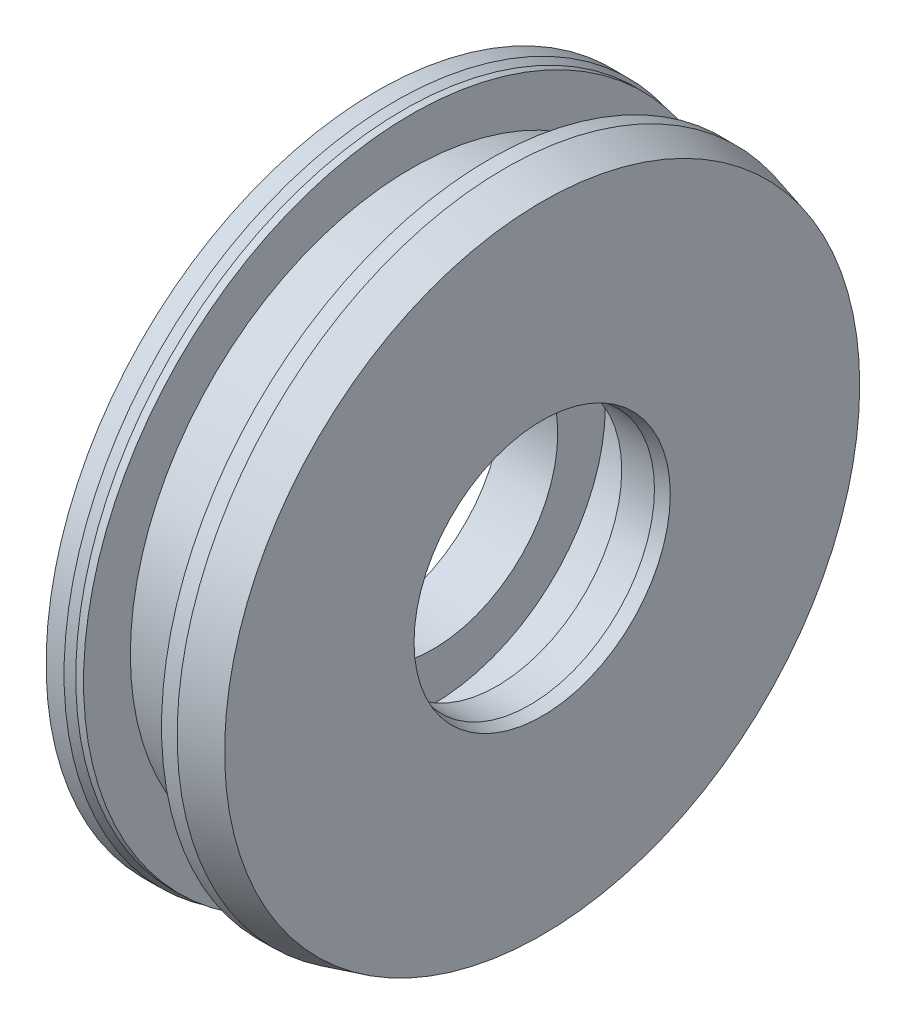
ISO-10303-21;
HEADER;
FILE_DESCRIPTION(('STEP AP214'),'2;1');
FILE_NAME('part.step','',(''),(''),'','','');
FILE_SCHEMA(('AUTOMOTIVE_DESIGN { 1 0 10303 214 1 1 1 1 }'));
ENDSEC;
DATA;
#1=APPLICATION_CONTEXT('core data for automotive mechanical design processes');
#2=APPLICATION_PROTOCOL_DEFINITION('international standard','automotive_design',2000,#1);
#3=PRODUCT_CONTEXT('',#1,'mechanical');
#4=PRODUCT('Part','Part','',(#3));
#5=PRODUCT_RELATED_PRODUCT_CATEGORY('part','',(#4));
#6=PRODUCT_DEFINITION_FORMATION('','',#4);
#7=PRODUCT_DEFINITION_CONTEXT('part definition',#1,'design');
#8=PRODUCT_DEFINITION('design','',#6,#7);
#9=PRODUCT_DEFINITION_SHAPE('','',#8);
#10=(LENGTH_UNIT() NAMED_UNIT(*) SI_UNIT(.MILLI.,.METRE.));
#11=(NAMED_UNIT(*) PLANE_ANGLE_UNIT() SI_UNIT($,.RADIAN.));
#12=(NAMED_UNIT(*) SI_UNIT($,.STERADIAN.) SOLID_ANGLE_UNIT());
#13=UNCERTAINTY_MEASURE_WITH_UNIT(LENGTH_MEASURE(1.E-05),#10,'distance_accuracy_value','');
#14=(GEOMETRIC_REPRESENTATION_CONTEXT(3) GLOBAL_UNCERTAINTY_ASSIGNED_CONTEXT((#13)) GLOBAL_UNIT_ASSIGNED_CONTEXT((#10,
#11,#12)) REPRESENTATION_CONTEXT('',''));
#15=CARTESIAN_POINT('',(0.,0.,0.));
#16=DIRECTION('',(0.,0.,1.));
#17=DIRECTION('',(1.,0.,0.));
#18=AXIS2_PLACEMENT_3D('',#15,#16,#17);
#19=CARTESIAN_POINT('',(0.,4.00000000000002,0.));
#20=DIRECTION('',(-1.,0.,0.));
#21=DIRECTION('',(0.,0.,1.));
#22=AXIS2_PLACEMENT_3D('',#19,#20,#21);
#23=PLANE('',#22);
#24=CARTESIAN_POINT('',(0.,0.,0.));
#25=DIRECTION('',(1.,0.,0.));
#26=DIRECTION('',(0.,0.,-1.));
#27=AXIS2_PLACEMENT_3D('',#24,#25,#26);
#28=CIRCLE('',#27,4.);
#29=CARTESIAN_POINT('',(0.,0.,-4.00000000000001));
#30=VERTEX_POINT('',#29);
#31=EDGE_CURVE('E400',#30,#30,#28,.T.);
#32=ORIENTED_EDGE('',*,*,#31,.T.);
#33=EDGE_LOOP('',(#32));
#34=FACE_BOUND('',#33,.T.);
#35=CARTESIAN_POINT('',(0.,0.,0.));
#36=DIRECTION('',(1.,0.,0.));
#37=DIRECTION('',(0.,0.,-1.));
#38=AXIS2_PLACEMENT_3D('',#35,#36,#37);
#39=CIRCLE('',#38,10.6);
#40=CARTESIAN_POINT('',(0.,0.,-10.6));
#41=VERTEX_POINT('',#40);
#42=EDGE_CURVE('E10',#41,#41,#39,.T.);
#43=ORIENTED_EDGE('',*,*,#42,.F.);
#44=EDGE_LOOP('',(#43));
#45=FACE_BOUND('',#44,.T.);
#46=ADVANCED_FACE('F348',(#34,#45),#23,.T.);
#47=CARTESIAN_POINT('',(0.,0.,0.));
#48=DIRECTION('',(1.,0.,0.));
#49=DIRECTION('',(0.,0.,-1.));
#50=AXIS2_PLACEMENT_3D('',#47,#48,#49);
#51=CYLINDRICAL_SURFACE('',#50,10.6);
#52=ORIENTED_EDGE('',*,*,#42,.T.);
#53=EDGE_LOOP('',(#52));
#54=FACE_BOUND('',#53,.T.);
#55=CARTESIAN_POINT('',(0.575252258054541,0.,0.));
#56=DIRECTION('',(1.,0.,0.));
#57=DIRECTION('',(0.,0.,-1.));
#58=AXIS2_PLACEMENT_3D('',#55,#56,#57);
#59=CIRCLE('',#58,10.6);
#60=CARTESIAN_POINT('',(0.575252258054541,0.,-10.6));
#61=VERTEX_POINT('',#60);
#62=EDGE_CURVE('E354',#61,#61,#59,.T.);
#63=ORIENTED_EDGE('',*,*,#62,.F.);
#64=EDGE_LOOP('',(#63));
#65=FACE_BOUND('',#64,.T.);
#66=ADVANCED_FACE('F418',(#54,#65),#51,.T.);
#67=CARTESIAN_POINT('',(0.85,0.,0.));
#68=DIRECTION('',(-1.,0.,0.));
#69=DIRECTION('',(0.,0.,1.));
#70=AXIS2_PLACEMENT_3D('',#67,#68,#69);
#71=CONICAL_SURFACE('',#70,10.5,0.349065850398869);
#72=ORIENTED_EDGE('',*,*,#62,.T.);
#73=EDGE_LOOP('',(#72));
#74=FACE_BOUND('',#73,.T.);
#75=CARTESIAN_POINT('',(0.85,0.,0.));
#76=DIRECTION('',(1.,0.,0.));
#77=DIRECTION('',(0.,0.,-1.));
#78=AXIS2_PLACEMENT_3D('',#75,#76,#77);
#79=CIRCLE('',#78,10.5);
#80=CARTESIAN_POINT('',(0.85,0.,-10.5));
#81=VERTEX_POINT('',#80);
#82=EDGE_CURVE('E358',#81,#81,#79,.T.);
#83=ORIENTED_EDGE('',*,*,#82,.F.);
#84=EDGE_LOOP('',(#83));
#85=FACE_BOUND('',#84,.T.);
#86=ADVANCED_FACE('F422',(#74,#85),#71,.T.);
#87=CARTESIAN_POINT('',(0.,0.,0.));
#88=DIRECTION('',(1.,0.,0.));
#89=DIRECTION('',(0.,0.,-1.));
#90=AXIS2_PLACEMENT_3D('',#87,#88,#89);
#91=CYLINDRICAL_SURFACE('',#90,10.5);
#92=ORIENTED_EDGE('',*,*,#82,.T.);
#93=EDGE_LOOP('',(#92));
#94=FACE_BOUND('',#93,.T.);
#95=CARTESIAN_POINT('',(1.1,0.,0.));
#96=DIRECTION('',(1.,0.,0.));
#97=DIRECTION('',(0.,0.,-1.));
#98=AXIS2_PLACEMENT_3D('',#95,#96,#97);
#99=CIRCLE('',#98,10.5);
#100=CARTESIAN_POINT('',(1.1,0.,-10.5));
#101=VERTEX_POINT('',#100);
#102=EDGE_CURVE('E362',#101,#101,#99,.T.);
#103=ORIENTED_EDGE('',*,*,#102,.F.);
#104=EDGE_LOOP('',(#103));
#105=FACE_BOUND('',#104,.T.);
#106=ADVANCED_FACE('F426',(#94,#105),#91,.T.);
#107=CARTESIAN_POINT('',(1.1,10.5,0.));
#108=DIRECTION('',(1.,0.,0.));
#109=DIRECTION('',(0.,0.,-1.));
#110=AXIS2_PLACEMENT_3D('',#107,#108,#109);
#111=PLANE('',#110);
#112=ORIENTED_EDGE('',*,*,#102,.T.);
#113=EDGE_LOOP('',(#112));
#114=FACE_BOUND('',#113,.T.);
#115=CARTESIAN_POINT('',(1.1,0.,0.));
#116=DIRECTION('',(1.,0.,0.));
#117=DIRECTION('',(0.,0.,-1.));
#118=AXIS2_PLACEMENT_3D('',#115,#116,#117);
#119=CIRCLE('',#118,9.);
#120=CARTESIAN_POINT('',(1.1,0.,-9.00000000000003));
#121=VERTEX_POINT('',#120);
#122=EDGE_CURVE('E367',#121,#121,#119,.T.);
#123=ORIENTED_EDGE('',*,*,#122,.F.);
#124=EDGE_LOOP('',(#123));
#125=FACE_BOUND('',#124,.T.);
#126=ADVANCED_FACE('F432',(#114,#125),#111,.T.);
#127=CARTESIAN_POINT('',(0.,0.,0.));
#128=DIRECTION('',(1.,0.,0.));
#129=DIRECTION('',(0.,0.,-1.));
#130=AXIS2_PLACEMENT_3D('',#127,#128,#129);
#131=CYLINDRICAL_SURFACE('',#130,9.);
#132=ORIENTED_EDGE('',*,*,#122,.T.);
#133=EDGE_LOOP('',(#132));
#134=FACE_BOUND('',#133,.T.);
#135=CARTESIAN_POINT('',(3.6,0.,0.));
#136=DIRECTION('',(1.,0.,0.));
#137=DIRECTION('',(0.,0.,-1.));
#138=AXIS2_PLACEMENT_3D('',#135,#136,#137);
#139=CIRCLE('',#138,9.);
#140=CARTESIAN_POINT('',(3.6,0.,-9.00000000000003));
#141=VERTEX_POINT('',#140);
#142=EDGE_CURVE('E370',#141,#141,#139,.T.);
#143=ORIENTED_EDGE('',*,*,#142,.F.);
#144=EDGE_LOOP('',(#143));
#145=FACE_BOUND('',#144,.T.);
#146=ADVANCED_FACE('F436',(#134,#145),#131,.T.);
#147=CARTESIAN_POINT('',(3.6,9.00000000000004,0.));
#148=DIRECTION('',(-1.,0.,0.));
#149=DIRECTION('',(0.,0.,1.));
#150=AXIS2_PLACEMENT_3D('',#147,#148,#149);
#151=PLANE('',#150);
#152=ORIENTED_EDGE('',*,*,#142,.T.);
#153=EDGE_LOOP('',(#152));
#154=FACE_BOUND('',#153,.T.);
#155=CARTESIAN_POINT('',(3.6,0.,0.));
#156=DIRECTION('',(1.,0.,0.));
#157=DIRECTION('',(0.,0.,-1.));
#158=AXIS2_PLACEMENT_3D('',#155,#156,#157);
#159=CIRCLE('',#158,10.5);
#160=CARTESIAN_POINT('',(3.6,0.,-10.5));
#161=VERTEX_POINT('',#160);
#162=EDGE_CURVE('E373',#161,#161,#159,.T.);
#163=ORIENTED_EDGE('',*,*,#162,.F.);
#164=EDGE_LOOP('',(#163));
#165=FACE_BOUND('',#164,.T.);
#166=ADVANCED_FACE('F440',(#154,#165),#151,.T.);
#167=CARTESIAN_POINT('',(0.,0.,0.));
#168=DIRECTION('',(1.,0.,0.));
#169=DIRECTION('',(0.,0.,-1.));
#170=AXIS2_PLACEMENT_3D('',#167,#168,#169);
#171=CYLINDRICAL_SURFACE('',#170,10.5);
#172=ORIENTED_EDGE('',*,*,#162,.T.);
#173=EDGE_LOOP('',(#172));
#174=FACE_BOUND('',#173,.T.);
#175=CARTESIAN_POINT('',(4.1,0.,0.));
#176=DIRECTION('',(1.,0.,0.));
#177=DIRECTION('',(0.,0.,-1.));
#178=AXIS2_PLACEMENT_3D('',#175,#176,#177);
#179=CIRCLE('',#178,10.5);
#180=CARTESIAN_POINT('',(4.1,0.,-10.5));
#181=VERTEX_POINT('',#180);
#182=EDGE_CURVE('E376',#181,#181,#179,.T.);
#183=ORIENTED_EDGE('',*,*,#182,.F.);
#184=EDGE_LOOP('',(#183));
#185=FACE_BOUND('',#184,.T.);
#186=ADVANCED_FACE('F444',(#174,#185),#171,.T.);
#187=CARTESIAN_POINT('',(5.3,0.,0.));
#188=DIRECTION('',(-1.,0.,0.));
#189=DIRECTION('',(0.,0.,1.));
#190=AXIS2_PLACEMENT_3D('',#187,#188,#189);
#191=CONICAL_SURFACE('',#190,10.1784609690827,0.26179938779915);
#192=ORIENTED_EDGE('',*,*,#182,.T.);
#193=EDGE_LOOP('',(#192));
#194=FACE_BOUND('',#193,.T.);
#195=CARTESIAN_POINT('',(5.3,0.,0.));
#196=DIRECTION('',(1.,0.,0.));
#197=DIRECTION('',(0.,0.,-1.));
#198=AXIS2_PLACEMENT_3D('',#195,#196,#197);
#199=CIRCLE('',#198,10.1784609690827);
#200=CARTESIAN_POINT('',(5.3,0.,-10.1784609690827));
#201=VERTEX_POINT('',#200);
#202=EDGE_CURVE('E379',#201,#201,#199,.T.);
#203=ORIENTED_EDGE('',*,*,#202,.F.);
#204=EDGE_LOOP('',(#203));
#205=FACE_BOUND('',#204,.T.);
#206=ADVANCED_FACE('F448',(#194,#205),#191,.T.);
#207=CARTESIAN_POINT('',(5.3,10.1784609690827,0.));
#208=DIRECTION('',(1.,0.,0.));
#209=DIRECTION('',(0.,0.,-1.));
#210=AXIS2_PLACEMENT_3D('',#207,#208,#209);
#211=PLANE('',#210);
#212=ORIENTED_EDGE('',*,*,#202,.T.);
#213=EDGE_LOOP('',(#212));
#214=FACE_BOUND('',#213,.T.);
#215=CARTESIAN_POINT('',(5.3,0.,0.));
#216=DIRECTION('',(1.,0.,0.));
#217=DIRECTION('',(0.,0.,-1.));
#218=AXIS2_PLACEMENT_3D('',#215,#216,#217);
#219=CIRCLE('',#218,4.10717967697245);
#220=CARTESIAN_POINT('',(5.3,0.,-4.10717967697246));
#221=VERTEX_POINT('',#220);
#222=EDGE_CURVE('E382',#221,#221,#219,.T.);
#223=ORIENTED_EDGE('',*,*,#222,.F.);
#224=EDGE_LOOP('',(#223));
#225=FACE_BOUND('',#224,.T.);
#226=ADVANCED_FACE('F452',(#214,#225),#211,.T.);
#227=CARTESIAN_POINT('',(4.9,0.,0.));
#228=DIRECTION('',(1.,0.,0.));
#229=DIRECTION('',(0.,0.,-1.));
#230=AXIS2_PLACEMENT_3D('',#227,#228,#229);
#231=CONICAL_SURFACE('',#230,4.,0.261799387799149);
#232=ORIENTED_EDGE('',*,*,#222,.T.);
#233=EDGE_LOOP('',(#232));
#234=FACE_BOUND('',#233,.T.);
#235=CARTESIAN_POINT('',(4.9,0.,0.));
#236=DIRECTION('',(1.,0.,0.));
#237=DIRECTION('',(0.,0.,-1.));
#238=AXIS2_PLACEMENT_3D('',#235,#236,#237);
#239=CIRCLE('',#238,4.);
#240=CARTESIAN_POINT('',(4.9,0.,-4.00000000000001));
#241=VERTEX_POINT('',#240);
#242=EDGE_CURVE('E385',#241,#241,#239,.T.);
#243=ORIENTED_EDGE('',*,*,#242,.F.);
#244=EDGE_LOOP('',(#243));
#245=FACE_BOUND('',#244,.T.);
#246=ADVANCED_FACE('F456',(#234,#245),#231,.F.);
#247=CARTESIAN_POINT('',(0.,0.,0.));
#248=DIRECTION('',(1.,0.,0.));
#249=DIRECTION('',(0.,0.,-1.));
#250=AXIS2_PLACEMENT_3D('',#247,#248,#249);
#251=CYLINDRICAL_SURFACE('',#250,4.);
#252=ORIENTED_EDGE('',*,*,#242,.T.);
#253=EDGE_LOOP('',(#252));
#254=FACE_BOUND('',#253,.T.);
#255=CARTESIAN_POINT('',(3.85,0.,0.));
#256=DIRECTION('',(1.,0.,0.));
#257=DIRECTION('',(0.,0.,-1.));
#258=AXIS2_PLACEMENT_3D('',#255,#256,#257);
#259=CIRCLE('',#258,4.);
#260=CARTESIAN_POINT('',(3.85,0.,-4.00000000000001));
#261=VERTEX_POINT('',#260);
#262=EDGE_CURVE('E388',#261,#261,#259,.T.);
#263=ORIENTED_EDGE('',*,*,#262,.F.);
#264=EDGE_LOOP('',(#263));
#265=FACE_BOUND('',#264,.T.);
#266=ADVANCED_FACE('F460',(#254,#265),#251,.F.);
#267=CARTESIAN_POINT('',(3.85,5.52500000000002,0.));
#268=DIRECTION('',(-1.,0.,0.));
#269=DIRECTION('',(0.,0.,1.));
#270=AXIS2_PLACEMENT_3D('',#267,#268,#269);
#271=PLANE('',#270);
#272=ORIENTED_EDGE('',*,*,#262,.T.);
#273=EDGE_LOOP('',(#272));
#274=FACE_BOUND('',#273,.T.);
#275=CARTESIAN_POINT('',(3.85,0.,0.));
#276=DIRECTION('',(1.,0.,0.));
#277=DIRECTION('',(0.,0.,-1.));
#278=AXIS2_PLACEMENT_3D('',#275,#276,#277);
#279=CIRCLE('',#278,5.525);
#280=CARTESIAN_POINT('',(3.85,0.,-5.52500000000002));
#281=VERTEX_POINT('',#280);
#282=EDGE_CURVE('E391',#281,#281,#279,.T.);
#283=ORIENTED_EDGE('',*,*,#282,.F.);
#284=EDGE_LOOP('',(#283));
#285=FACE_BOUND('',#284,.T.);
#286=ADVANCED_FACE('F464',(#274,#285),#271,.T.);
#287=CARTESIAN_POINT('',(0.,0.,0.));
#288=DIRECTION('',(1.,0.,0.));
#289=DIRECTION('',(0.,0.,-1.));
#290=AXIS2_PLACEMENT_3D('',#287,#288,#289);
#291=CYLINDRICAL_SURFACE('',#290,5.525);
#292=ORIENTED_EDGE('',*,*,#282,.T.);
#293=EDGE_LOOP('',(#292));
#294=FACE_BOUND('',#293,.T.);
#295=CARTESIAN_POINT('',(1.8,0.,0.));
#296=DIRECTION('',(1.,0.,0.));
#297=DIRECTION('',(0.,0.,-1.));
#298=AXIS2_PLACEMENT_3D('',#295,#296,#297);
#299=CIRCLE('',#298,5.525);
#300=CARTESIAN_POINT('',(1.8,0.,-5.52500000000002));
#301=VERTEX_POINT('',#300);
#302=EDGE_CURVE('E394',#301,#301,#299,.T.);
#303=ORIENTED_EDGE('',*,*,#302,.F.);
#304=EDGE_LOOP('',(#303));
#305=FACE_BOUND('',#304,.T.);
#306=ADVANCED_FACE('F414',(#294,#305),#291,.F.);
#307=CARTESIAN_POINT('',(1.8,4.00000000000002,0.));
#308=DIRECTION('',(1.,0.,0.));
#309=DIRECTION('',(0.,0.,-1.));
#310=AXIS2_PLACEMENT_3D('',#307,#308,#309);
#311=PLANE('',#310);
#312=ORIENTED_EDGE('',*,*,#302,.T.);
#313=EDGE_LOOP('',(#312));
#314=FACE_BOUND('',#313,.T.);
#315=CARTESIAN_POINT('',(1.8,0.,0.));
#316=DIRECTION('',(1.,0.,0.));
#317=DIRECTION('',(0.,0.,-1.));
#318=AXIS2_PLACEMENT_3D('',#315,#316,#317);
#319=CIRCLE('',#318,4.);
#320=CARTESIAN_POINT('',(1.8,0.,-4.00000000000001));
#321=VERTEX_POINT('',#320);
#322=EDGE_CURVE('E397',#321,#321,#319,.T.);
#323=ORIENTED_EDGE('',*,*,#322,.F.);
#324=EDGE_LOOP('',(#323));
#325=FACE_BOUND('',#324,.T.);
#326=ADVANCED_FACE('F408',(#314,#325),#311,.T.);
#327=CARTESIAN_POINT('',(0.,0.,0.));
#328=DIRECTION('',(1.,0.,0.));
#329=DIRECTION('',(0.,0.,-1.));
#330=AXIS2_PLACEMENT_3D('',#327,#328,#329);
#331=CYLINDRICAL_SURFACE('',#330,4.);
#332=ORIENTED_EDGE('',*,*,#322,.T.);
#333=EDGE_LOOP('',(#332));
#334=FACE_BOUND('',#333,.T.);
#335=ORIENTED_EDGE('',*,*,#31,.F.);
#336=EDGE_LOOP('',(#335));
#337=FACE_BOUND('',#336,.T.);
#338=ADVANCED_FACE('F406',(#334,#337),#331,.F.);
#339=CLOSED_SHELL('',(#46,#66,#86,#106,#126,#146,#166,#186,#206,#226,#246,#266,#286,#306,#326,#338));
#340=MANIFOLD_SOLID_BREP('B2',#339);
#341=ADVANCED_BREP_SHAPE_REPRESENTATION('',(#18,#340),#14);
#342=SHAPE_DEFINITION_REPRESENTATION(#9,#341);
ENDSEC;
END-ISO-10303-21;
